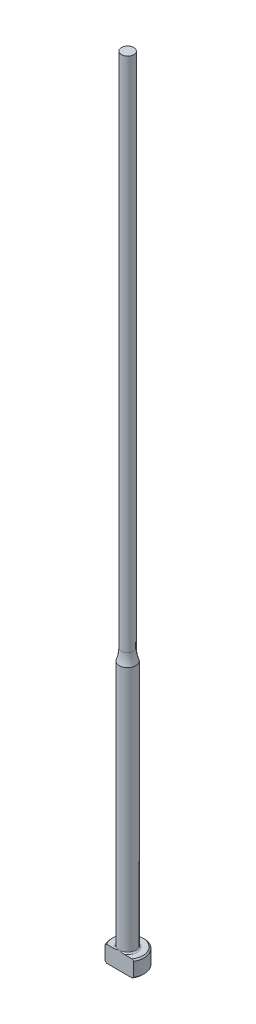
ISO-10303-21;
HEADER;
FILE_DESCRIPTION(('STEP AP214'),'2;1');
FILE_NAME('part.step','',(''),(''),'','','');
FILE_SCHEMA(('AUTOMOTIVE_DESIGN { 1 0 10303 214 1 1 1 1 }'));
ENDSEC;
DATA;
#1=APPLICATION_CONTEXT('core data for automotive mechanical design processes');
#2=APPLICATION_PROTOCOL_DEFINITION('international standard','automotive_design',2000,#1);
#3=PRODUCT_CONTEXT('',#1,'mechanical');
#4=PRODUCT('Part','Part','',(#3));
#5=PRODUCT_RELATED_PRODUCT_CATEGORY('part','',(#4));
#6=PRODUCT_DEFINITION_FORMATION('','',#4);
#7=PRODUCT_DEFINITION_CONTEXT('part definition',#1,'design');
#8=PRODUCT_DEFINITION('design','',#6,#7);
#9=PRODUCT_DEFINITION_SHAPE('','',#8);
#10=(LENGTH_UNIT() NAMED_UNIT(*) SI_UNIT(.MILLI.,.METRE.));
#11=(NAMED_UNIT(*) PLANE_ANGLE_UNIT() SI_UNIT($,.RADIAN.));
#12=(NAMED_UNIT(*) SI_UNIT($,.STERADIAN.) SOLID_ANGLE_UNIT());
#13=UNCERTAINTY_MEASURE_WITH_UNIT(LENGTH_MEASURE(1.E-05),#10,'distance_accuracy_value','');
#14=(GEOMETRIC_REPRESENTATION_CONTEXT(3) GLOBAL_UNCERTAINTY_ASSIGNED_CONTEXT((#13)) GLOBAL_UNIT_ASSIGNED_CONTEXT((#10,
#11,#12)) REPRESENTATION_CONTEXT('',''));
#15=CARTESIAN_POINT('',(0.,0.,0.));
#16=DIRECTION('',(0.,0.,1.));
#17=DIRECTION('',(1.,0.,0.));
#18=AXIS2_PLACEMENT_3D('',#15,#16,#17);
#19=CARTESIAN_POINT('',(-1.18998999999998,152.4,0.));
#20=DIRECTION('',(0.,1.,0.));
#21=DIRECTION('',(0.,0.,1.));
#22=AXIS2_PLACEMENT_3D('',#19,#20,#21);
#23=PLANE('',#22);
#24=CARTESIAN_POINT('',(0.,152.4,0.));
#25=DIRECTION('',(0.,1.,0.));
#26=DIRECTION('',(0.,0.,1.));
#27=AXIS2_PLACEMENT_3D('',#24,#25,#26);
#28=CIRCLE('',#27,1.18998999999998);
#29=CARTESIAN_POINT('',(0.,152.4,1.18998999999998));
#30=VERTEX_POINT('',#29);
#31=EDGE_CURVE('E169',#30,#30,#28,.T.);
#32=ORIENTED_EDGE('',*,*,#31,.T.);
#33=EDGE_LOOP('',(#32));
#34=FACE_BOUND('',#33,.T.);
#35=ADVANCED_FACE('F37',(#34),#23,.T.);
#36=CARTESIAN_POINT('',(0.,259.958771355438,0.));
#37=DIRECTION('',(0.,1.,0.));
#38=DIRECTION('',(0.,0.,1.));
#39=AXIS2_PLACEMENT_3D('',#36,#37,#38);
#40=CYLINDRICAL_SURFACE('',#39,1.18998999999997);
#41=CARTESIAN_POINT('',(0.,53.0114164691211,0.));
#42=DIRECTION('',(0.,1.,0.));
#43=DIRECTION('',(0.,0.,1.));
#44=AXIS2_PLACEMENT_3D('',#41,#42,#43);
#45=CIRCLE('',#44,1.18998999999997);
#46=CARTESIAN_POINT('',(0.,53.0114164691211,1.18998999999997));
#47=VERTEX_POINT('',#46);
#48=EDGE_CURVE('E172',#47,#47,#45,.T.);
#49=ORIENTED_EDGE('',*,*,#48,.T.);
#50=EDGE_LOOP('',(#49));
#51=FACE_BOUND('',#50,.T.);
#52=ORIENTED_EDGE('',*,*,#31,.F.);
#53=EDGE_LOOP('',(#52));
#54=FACE_BOUND('',#53,.T.);
#55=ADVANCED_FACE('F160',(#51,#54),#40,.T.);
#56=CARTESIAN_POINT('',(0.,53.0114164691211,0.));
#57=DIRECTION('',(0.,1.,0.));
#58=DIRECTION('',(0.,0.,1.));
#59=AXIS2_PLACEMENT_3D('',#56,#57,#58);
#60=TOROIDAL_SURFACE('',#59,7.53998999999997,6.35);
#61=CARTESIAN_POINT('',(0.,50.8,0.));
#62=DIRECTION('',(0.,1.,0.));
#63=DIRECTION('',(0.,0.,1.));
#64=AXIS2_PLACEMENT_3D('',#61,#62,#63);
#65=CIRCLE('',#64,1.58749999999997);
#66=CARTESIAN_POINT('',(0.,50.8,1.58749999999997));
#67=VERTEX_POINT('',#66);
#68=EDGE_CURVE('E100',#67,#67,#65,.T.);
#69=ORIENTED_EDGE('',*,*,#68,.T.);
#70=EDGE_LOOP('',(#69));
#71=FACE_BOUND('',#70,.T.);
#72=ORIENTED_EDGE('',*,*,#48,.F.);
#73=EDGE_LOOP('',(#72));
#74=FACE_BOUND('',#73,.T.);
#75=ADVANCED_FACE('F165',(#71,#74),#60,.F.);
#76=CARTESIAN_POINT('',(0.,259.958771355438,0.));
#77=DIRECTION('',(0.,1.,0.));
#78=DIRECTION('',(0.,0.,1.));
#79=AXIS2_PLACEMENT_3D('',#76,#77,#78);
#80=CYLINDRICAL_SURFACE('',#79,1.58749999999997);
#81=CARTESIAN_POINT('',(0.,3.42900000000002,0.));
#82=DIRECTION('',(0.,1.,0.));
#83=DIRECTION('',(0.,0.,1.));
#84=AXIS2_PLACEMENT_3D('',#81,#82,#83);
#85=CIRCLE('',#84,1.58749999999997);
#86=CARTESIAN_POINT('',(0.,3.42900000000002,1.58749999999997));
#87=VERTEX_POINT('',#86);
#88=EDGE_CURVE('E109',#87,#87,#85,.T.);
#89=ORIENTED_EDGE('',*,*,#88,.T.);
#90=EDGE_LOOP('',(#89));
#91=FACE_BOUND('',#90,.T.);
#92=ORIENTED_EDGE('',*,*,#68,.F.);
#93=EDGE_LOOP('',(#92));
#94=FACE_BOUND('',#93,.T.);
#95=ADVANCED_FACE('F192',(#91,#94),#80,.T.);
#96=CARTESIAN_POINT('',(-3.17499999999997,3.175,0.));
#97=DIRECTION('',(0.,1.,0.));
#98=DIRECTION('',(0.,0.,1.));
#99=AXIS2_PLACEMENT_3D('',#96,#97,#98);
#100=PLANE('',#99);
#101=DIRECTION('',(-1.,0.,0.));
#102=VECTOR('',#101,1.);
#103=CARTESIAN_POINT('',(-3.17499999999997,3.175,1.58749999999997));
#104=LINE('',#103,#102);
#105=CARTESIAN_POINT('',(2.45195529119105,3.175,1.58749999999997));
#106=VERTEX_POINT('',#105);
#107=CARTESIAN_POINT('',(0.933255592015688,3.175,1.58749999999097));
#108=VERTEX_POINT('',#107);
#109=EDGE_CURVE('E58',#106,#108,#104,.T.);
#110=ORIENTED_EDGE('',*,*,#109,.F.);
#111=CARTESIAN_POINT('',(0.,3.175,0.));
#112=DIRECTION('',(0.,1.,0.));
#113=DIRECTION('',(0.,0.,1.));
#114=AXIS2_PLACEMENT_3D('',#111,#112,#113);
#115=CIRCLE('',#114,2.92099999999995);
#116=CARTESIAN_POINT('',(-2.45195529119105,3.175,1.58749999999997));
#117=VERTEX_POINT('',#116);
#118=EDGE_CURVE('E171',#106,#117,#115,.T.);
#119=ORIENTED_EDGE('',*,*,#118,.T.);
#120=CARTESIAN_POINT('',(-0.933255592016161,3.17500000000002,1.58749999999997));
#121=VERTEX_POINT('',#120);
#122=EDGE_CURVE('E140',#121,#117,#104,.T.);
#123=ORIENTED_EDGE('',*,*,#122,.F.);
#124=CARTESIAN_POINT('',(0.,3.175,0.));
#125=DIRECTION('',(0.,1.,0.));
#126=DIRECTION('',(0.,0.,1.));
#127=AXIS2_PLACEMENT_3D('',#124,#125,#126);
#128=CIRCLE('',#127,1.84149999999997);
#129=EDGE_CURVE('E113',#121,#108,#128,.F.);
#130=ORIENTED_EDGE('',*,*,#129,.T.);
#131=EDGE_LOOP('',(#110,#119,#123,#130));
#132=FACE_BOUND('',#131,.T.);
#133=ADVANCED_FACE('F189',(#132),#100,.T.);
#134=CARTESIAN_POINT('',(0.,259.958771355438,0.));
#135=DIRECTION('',(0.,1.,0.));
#136=DIRECTION('',(0.,0.,1.));
#137=AXIS2_PLACEMENT_3D('',#134,#135,#136);
#138=CYLINDRICAL_SURFACE('',#137,3.17499999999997);
#139=DIRECTION('',(0.,-1.,0.));
#140=VECTOR('',#139,1.);
#141=CARTESIAN_POINT('',(-2.74963065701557,152.4,1.58749999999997));
#142=LINE('',#141,#140);
#143=CARTESIAN_POINT('',(-2.74963065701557,2.921,1.58749999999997));
#144=VERTEX_POINT('',#143);
#145=CARTESIAN_POINT('',(-2.74963065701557,0.254000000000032,1.58749999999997));
#146=VERTEX_POINT('',#145);
#147=EDGE_CURVE('E95',#144,#146,#142,.T.);
#148=ORIENTED_EDGE('',*,*,#147,.F.);
#149=CARTESIAN_POINT('',(0.,2.92100000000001,0.));
#150=DIRECTION('',(0.,1.,0.));
#151=DIRECTION('',(0.,0.,1.));
#152=AXIS2_PLACEMENT_3D('',#149,#150,#151);
#153=CIRCLE('',#152,3.17499999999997);
#154=CARTESIAN_POINT('',(2.74963065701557,2.921,1.58749999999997));
#155=VERTEX_POINT('',#154);
#156=EDGE_CURVE('E110',#144,#155,#153,.F.);
#157=ORIENTED_EDGE('',*,*,#156,.T.);
#158=DIRECTION('',(0.,-1.,0.));
#159=VECTOR('',#158,1.);
#160=CARTESIAN_POINT('',(2.74963065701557,152.4,1.58749999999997));
#161=LINE('',#160,#159);
#162=CARTESIAN_POINT('',(2.74963065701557,0.254000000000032,1.58749999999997));
#163=VERTEX_POINT('',#162);
#164=EDGE_CURVE('E182',#155,#163,#161,.T.);
#165=ORIENTED_EDGE('',*,*,#164,.T.);
#166=CARTESIAN_POINT('',(0.,0.254000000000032,0.));
#167=DIRECTION('',(0.,-1.,0.));
#168=DIRECTION('',(0.,0.,-1.));
#169=AXIS2_PLACEMENT_3D('',#166,#167,#168);
#170=CIRCLE('',#169,3.17499999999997);
#171=EDGE_CURVE('E116',#163,#146,#170,.F.);
#172=ORIENTED_EDGE('',*,*,#171,.T.);
#173=EDGE_LOOP('',(#148,#157,#165,#172));
#174=FACE_BOUND('',#173,.T.);
#175=ADVANCED_FACE('F180',(#174),#138,.T.);
#176=CARTESIAN_POINT('',(0.,0.,0.));
#177=DIRECTION('',(0.,-1.,0.));
#178=DIRECTION('',(0.,0.,-1.));
#179=AXIS2_PLACEMENT_3D('',#176,#177,#178);
#180=PLANE('',#179);
#181=DIRECTION('',(1.,0.,0.));
#182=VECTOR('',#181,1.);
#183=CARTESIAN_POINT('',(-2.74963065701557,0.,1.58749999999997));
#184=LINE('',#183,#182);
#185=CARTESIAN_POINT('',(-2.45195529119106,0.,1.58749999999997));
#186=VERTEX_POINT('',#185);
#187=CARTESIAN_POINT('',(2.45195529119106,0.,1.58749999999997));
#188=VERTEX_POINT('',#187);
#189=EDGE_CURVE('E92',#186,#188,#184,.T.);
#190=ORIENTED_EDGE('',*,*,#189,.F.);
#191=CARTESIAN_POINT('',(0.,0.,0.));
#192=DIRECTION('',(0.,-1.,0.));
#193=DIRECTION('',(0.,0.,-1.));
#194=AXIS2_PLACEMENT_3D('',#191,#192,#193);
#195=CIRCLE('',#194,2.92099999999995);
#196=EDGE_CURVE('E106',#186,#188,#195,.T.);
#197=ORIENTED_EDGE('',*,*,#196,.T.);
#198=EDGE_LOOP('',(#190,#197));
#199=FACE_BOUND('',#198,.T.);
#200=ADVANCED_FACE('F105',(#199),#180,.T.);
#201=CARTESIAN_POINT('',(0.,3.17499999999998,0.));
#202=DIRECTION('',(0.,-1.,0.));
#203=DIRECTION('',(0.,0.,-1.));
#204=AXIS2_PLACEMENT_3D('',#201,#202,#203);
#205=CONICAL_SURFACE('',#204,2.92099999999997,0.7853981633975);
#206=CARTESIAN_POINT('',(2.75033065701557,2.9203937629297,1.58749999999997));
#207=CARTESIAN_POINT('',(2.66887796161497,2.99091042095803,1.58749999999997));
#208=CARTESIAN_POINT('',(2.58705989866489,3.0610138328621,1.58749999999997));
#209=CARTESIAN_POINT('',(2.42241022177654,3.20009957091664,1.58749999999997));
#210=CARTESIAN_POINT('',(2.33957813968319,3.26908134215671,1.58749999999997));
#211=CARTESIAN_POINT('',(2.17073968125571,3.40716024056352,1.58749999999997));
#212=CARTESIAN_POINT('',(2.08470440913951,3.47622217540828,1.58749999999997));
#213=CARTESIAN_POINT('',(1.91099881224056,3.61222325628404,1.58749999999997));
#214=CARTESIAN_POINT('',(1.82332890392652,3.67916293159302,1.58749999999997));
#215=CARTESIAN_POINT('',(1.64569223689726,3.81020667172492,1.58749999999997));
#216=CARTESIAN_POINT('',(1.55572245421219,3.87430666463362,1.58749999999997));
#217=CARTESIAN_POINT('',(1.37280394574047,3.99833089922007,1.58749999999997));
#218=CARTESIAN_POINT('',(1.27985285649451,4.05825170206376,1.58749999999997));
#219=CARTESIAN_POINT('',(1.09086561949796,4.17130826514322,1.58749999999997));
#220=CARTESIAN_POINT('',(0.99485990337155,4.22449421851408,1.58749999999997));
#221=CARTESIAN_POINT('',(0.798114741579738,4.32122233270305,1.58749999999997));
#222=CARTESIAN_POINT('',(0.697384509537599,4.36478238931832,1.58749999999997));
#223=CARTESIAN_POINT('',(0.541185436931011,4.4195165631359,1.58749999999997));
#224=CARTESIAN_POINT('',(0.487627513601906,4.43611950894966,1.58749999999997));
#225=CARTESIAN_POINT('',(0.379267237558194,4.46466012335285,1.58749999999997));
#226=CARTESIAN_POINT('',(0.324465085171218,4.47659853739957,1.58749999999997));
#227=CARTESIAN_POINT('',(0.214272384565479,4.49501904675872,1.58749999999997));
#228=CARTESIAN_POINT('',(0.158887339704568,4.50153345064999,1.58749999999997));
#229=CARTESIAN_POINT('',(0.0477364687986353,4.50875028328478,1.58749999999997));
#230=CARTESIAN_POINT('',(-0.00802931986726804,4.50945327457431,1.58749999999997));
#231=CARTESIAN_POINT('',(-0.119372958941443,4.50499163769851,1.58749999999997));
#232=CARTESIAN_POINT('',(-0.174950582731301,4.49982147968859,1.58749999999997));
#233=CARTESIAN_POINT('',(-0.285312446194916,4.48399101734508,1.58749999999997));
#234=CARTESIAN_POINT('',(-0.340096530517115,4.47332965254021,1.58749999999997));
#235=CARTESIAN_POINT('',(-0.448865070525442,4.44711334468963,1.58749999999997));
#236=CARTESIAN_POINT('',(-0.50284128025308,4.43152477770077,1.58749999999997));
#237=CARTESIAN_POINT('',(-0.609429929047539,4.39628553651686,1.58749999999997));
#238=CARTESIAN_POINT('',(-0.66204236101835,4.3766348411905,1.58749999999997));
#239=CARTESIAN_POINT('',(-0.778129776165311,4.32902110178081,1.58749999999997));
#240=CARTESIAN_POINT('',(-0.84124591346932,4.30019026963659,1.58749999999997));
#241=CARTESIAN_POINT('',(-0.965594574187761,4.23868811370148,1.58749999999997));
#242=CARTESIAN_POINT('',(-1.02682597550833,4.20601455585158,1.58749999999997));
#243=CARTESIAN_POINT('',(-1.14774341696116,4.13769010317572,1.58749999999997));
#244=CARTESIAN_POINT('',(-1.20742632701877,4.10203371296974,1.58749999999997));
#245=CARTESIAN_POINT('',(-1.32539130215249,4.02846531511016,1.58749999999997));
#246=CARTESIAN_POINT('',(-1.38367308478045,3.9905528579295,1.58749999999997));
#247=CARTESIAN_POINT('',(-1.55734442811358,3.87382704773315,1.58749999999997));
#248=CARTESIAN_POINT('',(-1.67095842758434,3.79237897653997,1.58749999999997));
#249=CARTESIAN_POINT('',(-1.8947523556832,3.6252186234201,1.58749999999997));
#250=CARTESIAN_POINT('',(-2.00493591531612,3.53951111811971,1.58749999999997));
#251=CARTESIAN_POINT('',(-2.22248693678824,3.3655494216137,1.58749999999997));
#252=CARTESIAN_POINT('',(-2.32986450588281,3.27730782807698,1.58749999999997));
#253=CARTESIAN_POINT('',(-2.48909538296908,3.14389342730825,1.58749999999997));
#254=CARTESIAN_POINT('',(-2.54159338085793,3.09948435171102,1.58749999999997));
#255=CARTESIAN_POINT('',(-2.64622282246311,3.01024124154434,1.58749999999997));
#256=CARTESIAN_POINT('',(-2.69835428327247,2.96540722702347,1.58749999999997));
#257=CARTESIAN_POINT('',(-2.75033065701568,2.92039376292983,1.58749999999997));
#258=B_SPLINE_CURVE_WITH_KNOTS('',3,(#206,#207,#208,#209,#210,#211,#212,#213,#214,#215,#216,
#217,#218,#219,#220,#221,#222,#223,#224,#225,#226,#227,#228,#229,#230,#231,#232,#233,#234,#235,
#236,#237,#238,#239,#240,#241,#242,#243,#244,#245,#246,#247,#248,#249,#250,#251,#252,#253,#254,
#255,#256,#257),.UNSPECIFIED.,.F.,.F.,(4,2,2,2,2,2,2,2,2,2,2,2,2,2,2,2,2,2,2,2,2,2,2,2,2,4),(0.,
0.323216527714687,0.64658837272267,0.977539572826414,1.30840757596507,1.63973560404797,
1.97133312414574,2.30029221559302,2.62863448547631,2.79668277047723,2.9647041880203,
3.13171746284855,3.29871457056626,3.46586904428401,3.63305581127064,3.80140905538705,
3.96976317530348,4.17775353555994,4.38586541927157,4.59436953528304,4.80291533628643,
5.22209642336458,5.64081759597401,6.0577303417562,6.26401477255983,6.47028951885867),.UNSPECIFIED.);
#259=EDGE_CURVE('E63',#155,#106,#258,.T.);
#260=ORIENTED_EDGE('',*,*,#259,.F.);
#261=ORIENTED_EDGE('',*,*,#156,.F.);
#262=EDGE_CURVE('E133',#117,#144,#258,.T.);
#263=ORIENTED_EDGE('',*,*,#262,.F.);
#264=ORIENTED_EDGE('',*,*,#118,.F.);
#265=EDGE_LOOP('',(#260,#261,#263,#264));
#266=FACE_BOUND('',#265,.T.);
#267=ADVANCED_FACE('F147',(#266),#205,.T.);
#268=CARTESIAN_POINT('',(0.,0.254000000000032,0.));
#269=DIRECTION('',(0.,1.,0.));
#270=DIRECTION('',(0.,0.,1.));
#271=AXIS2_PLACEMENT_3D('',#268,#269,#270);
#272=CONICAL_SURFACE('',#271,3.17499999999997,0.785398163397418);
#273=CARTESIAN_POINT('',(-2.75033065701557,0.254606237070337,1.58749999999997));
#274=CARTESIAN_POINT('',(-2.66887796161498,0.184089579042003,1.58749999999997));
#275=CARTESIAN_POINT('',(-2.58705989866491,0.113986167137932,1.58749999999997));
#276=CARTESIAN_POINT('',(-2.42241022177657,-0.0250995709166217,1.58749999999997));
#277=CARTESIAN_POINT('',(-2.33957813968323,-0.0940813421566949,1.58749999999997));
#278=CARTESIAN_POINT('',(-2.17073968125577,-0.232160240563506,1.58749999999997));
#279=CARTESIAN_POINT('',(-2.08470440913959,-0.301222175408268,1.58749999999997));
#280=CARTESIAN_POINT('',(-1.91099881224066,-0.437223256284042,1.58749999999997));
#281=CARTESIAN_POINT('',(-1.82332890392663,-0.504162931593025,1.58749999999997));
#282=CARTESIAN_POINT('',(-1.64569223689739,-0.635206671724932,1.58749999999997));
#283=CARTESIAN_POINT('',(-1.55572245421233,-0.699306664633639,1.58749999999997));
#284=CARTESIAN_POINT('',(-1.37280394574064,-0.8233308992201,1.58749999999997));
#285=CARTESIAN_POINT('',(-1.27985285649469,-0.883251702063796,1.58749999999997));
#286=CARTESIAN_POINT('',(-1.09086561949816,-0.996308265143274,1.58749999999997));
#287=CARTESIAN_POINT('',(-0.994859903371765,-1.04949421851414,1.58749999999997));
#288=CARTESIAN_POINT('',(-0.798114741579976,-1.14622233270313,1.58749999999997));
#289=CARTESIAN_POINT('',(-0.697384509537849,-1.18978238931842,1.58749999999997));
#290=CARTESIAN_POINT('',(-0.54118543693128,-1.24451656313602,1.58749999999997));
#291=CARTESIAN_POINT('',(-0.487627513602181,-1.26111950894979,1.58749999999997));
#292=CARTESIAN_POINT('',(-0.379267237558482,-1.28966012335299,1.58749999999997));
#293=CARTESIAN_POINT('',(-0.324465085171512,-1.30159853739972,1.58749999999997));
#294=CARTESIAN_POINT('',(-0.214272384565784,-1.3200190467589,1.58749999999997));
#295=CARTESIAN_POINT('',(-0.158887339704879,-1.32653345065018,1.58749999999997));
#296=CARTESIAN_POINT('',(-0.0477364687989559,-1.33375028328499,1.58749999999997));
#297=CARTESIAN_POINT('',(0.00802931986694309,-1.33445327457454,1.58749999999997));
#298=CARTESIAN_POINT('',(0.119372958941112,-1.32999163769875,1.58749999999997));
#299=CARTESIAN_POINT('',(0.174950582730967,-1.32482147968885,1.58749999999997));
#300=CARTESIAN_POINT('',(0.28531244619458,-1.30899101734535,1.58749999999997));
#301=CARTESIAN_POINT('',(0.340096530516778,-1.2983296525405,1.58749999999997));
#302=CARTESIAN_POINT('',(0.448865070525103,-1.27211334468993,1.58749999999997));
#303=CARTESIAN_POINT('',(0.50284128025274,-1.25652477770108,1.58749999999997));
#304=CARTESIAN_POINT('',(0.609429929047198,-1.22128553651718,1.58749999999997));
#305=CARTESIAN_POINT('',(0.662042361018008,-1.20163484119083,1.58749999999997));
#306=CARTESIAN_POINT('',(0.778129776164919,-1.15402110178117,1.58749999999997));
#307=CARTESIAN_POINT('',(0.84124591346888,-1.12519026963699,1.58749999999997));
#308=CARTESIAN_POINT('',(0.965594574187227,-1.06368811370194,1.58749999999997));
#309=CARTESIAN_POINT('',(1.02682597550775,-1.03101455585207,1.58749999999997));
#310=CARTESIAN_POINT('',(1.14774341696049,-0.962690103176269,1.58749999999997));
#311=CARTESIAN_POINT('',(1.20742632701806,-0.927033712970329,1.58749999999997));
#312=CARTESIAN_POINT('',(1.32539130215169,-0.853465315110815,1.58749999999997));
#313=CARTESIAN_POINT('',(1.38367308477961,-0.815552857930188,1.58749999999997));
#314=CARTESIAN_POINT('',(1.5573444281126,-0.698827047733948,1.58749999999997));
#315=CARTESIAN_POINT('',(1.67095842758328,-0.617378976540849,1.58749999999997));
#316=CARTESIAN_POINT('',(1.89475235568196,-0.450218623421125,1.58749999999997));
#317=CARTESIAN_POINT('',(2.0049359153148,-0.364511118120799,1.58749999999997));
#318=CARTESIAN_POINT('',(2.22248693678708,-0.190549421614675,1.58749999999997));
#319=CARTESIAN_POINT('',(2.32986450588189,-0.102307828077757,1.58749999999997));
#320=CARTESIAN_POINT('',(2.48909538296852,0.0311065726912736,1.58749999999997));
#321=CARTESIAN_POINT('',(2.54159338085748,0.0755156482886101,1.58749999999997));
#322=CARTESIAN_POINT('',(2.64622282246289,0.164758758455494,1.58749999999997));
#323=CARTESIAN_POINT('',(2.69835428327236,0.20959277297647,1.58749999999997));
#324=CARTESIAN_POINT('',(2.75033065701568,0.25460623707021,1.58749999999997));
#325=B_SPLINE_CURVE_WITH_KNOTS('',3,(#273,#274,#275,#276,#277,#278,#279,#280,#281,#282,#283,
#284,#285,#286,#287,#288,#289,#290,#291,#292,#293,#294,#295,#296,#297,#298,#299,#300,#301,#302,
#303,#304,#305,#306,#307,#308,#309,#310,#311,#312,#313,#314,#315,#316,#317,#318,#319,#320,#321,
#322,#323,#324),.UNSPECIFIED.,.F.,.F.,(4,2,2,2,2,2,2,2,2,2,2,2,2,2,2,2,2,2,2,2,2,2,2,2,2,4),(0.,
0.323216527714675,0.646588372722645,0.977539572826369,1.308407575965,1.63973560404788,
1.97133312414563,2.3002922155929,2.62863448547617,2.79668277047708,2.96470418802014,
3.13171746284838,3.29871457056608,3.46586904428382,3.63305581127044,3.80140905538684,
3.96976317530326,4.17775353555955,4.38586541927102,4.59436953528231,4.80291533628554,
5.22209642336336,5.64081759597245,6.05773034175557,6.26401477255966,6.47028951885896),.UNSPECIFIED.);
#326=EDGE_CURVE('E89',#146,#186,#325,.T.);
#327=ORIENTED_EDGE('',*,*,#326,.F.);
#328=ORIENTED_EDGE('',*,*,#171,.F.);
#329=EDGE_CURVE('E101',#188,#163,#325,.T.);
#330=ORIENTED_EDGE('',*,*,#329,.F.);
#331=ORIENTED_EDGE('',*,*,#196,.F.);
#332=EDGE_LOOP('',(#327,#328,#330,#331));
#333=FACE_BOUND('',#332,.T.);
#334=ADVANCED_FACE('F108',(#333),#272,.T.);
#335=CARTESIAN_POINT('',(0.,3.42900000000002,0.));
#336=DIRECTION('',(0.,1.,0.));
#337=DIRECTION('',(0.,0.,1.));
#338=AXIS2_PLACEMENT_3D('',#335,#336,#337);
#339=TOROIDAL_SURFACE('',#338,1.84149999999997,0.254);
#340=ORIENTED_EDGE('',*,*,#129,.F.);
#341=CARTESIAN_POINT('',(0.,3.42900000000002,1.58749999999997));
#342=CARTESIAN_POINT('',(-1.9220500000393E-10,3.42900057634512,1.58749999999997));
#343=CARTESIAN_POINT('',(-1.22611614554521E-07,3.42900115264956,1.58749999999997));
#344=CARTESIAN_POINT('',(-5.09676364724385E-07,3.42900226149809,1.58749999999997));
#345=CARTESIAN_POINT('',(-7.78176327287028E-07,3.42900279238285,1.58749999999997));
#346=CARTESIAN_POINT('',(-1.42307272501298E-06,3.42900385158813,1.58749999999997));
#347=CARTESIAN_POINT('',(-1.80713867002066E-06,3.42900437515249,1.58749999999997));
#348=CARTESIAN_POINT('',(-2.63494846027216E-06,3.42900536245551,1.58749999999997));
#349=CARTESIAN_POINT('',(-3.07814756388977E-06,3.42900582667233,1.58749999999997));
#350=CARTESIAN_POINT('',(-4.66897357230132E-06,3.42900738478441,1.58749999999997));
#351=CARTESIAN_POINT('',(-5.89404907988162E-06,3.42900840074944,1.58749999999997));
#352=CARTESIAN_POINT('',(-8.42427510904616E-06,3.42901020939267,1.58749999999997));
#353=CARTESIAN_POINT('',(-9.72480574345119E-06,3.42901100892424,1.58749999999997));
#354=CARTESIAN_POINT('',(-1.48060601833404E-05,3.42901401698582,1.58749999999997));
#355=CARTESIAN_POINT('',(-1.86838281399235E-05,3.42901606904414,1.58749999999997));
#356=CARTESIAN_POINT('',(-2.63261117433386E-05,3.42901942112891,1.58749999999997));
#357=CARTESIAN_POINT('',(-3.0068741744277E-05,3.42902077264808,1.58749999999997));
#358=CARTESIAN_POINT('',(-4.60276298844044E-05,3.42902652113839,1.58749999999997));
#359=CARTESIAN_POINT('',(-5.82470198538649E-05,3.42903088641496,1.58749999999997));
#360=CARTESIAN_POINT('',(-8.11070097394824E-05,3.42903788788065,1.58749999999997));
#361=CARTESIAN_POINT('',(-9.16953114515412E-05,3.42904068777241,1.58749999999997));
#362=CARTESIAN_POINT('',(-0.000168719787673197,3.42906287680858,1.58749999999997));
#363=CARTESIAN_POINT('',(-0.000232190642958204,3.4290911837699,1.58749999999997));
#364=CARTESIAN_POINT('',(-0.000479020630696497,3.42919723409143,1.58749999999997));
#365=CARTESIAN_POINT('',(-0.000664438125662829,3.42926834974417,1.58749999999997));
#366=CARTESIAN_POINT('',(-0.0013844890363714,3.42954862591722,1.58749999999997));
#367=CARTESIAN_POINT('',(-0.00191701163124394,3.42976473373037,1.58749999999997));
#368=CARTESIAN_POINT('',(-0.00409774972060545,3.4306455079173,1.58749999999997));
#369=CARTESIAN_POINT('',(-0.00574830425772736,3.43130231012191,1.58749999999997));
#370=CARTESIAN_POINT('',(-0.0289985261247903,3.4405594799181,1.58749999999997));
#371=CARTESIAN_POINT('',(-0.0505816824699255,3.4492167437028,1.58749999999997));
#372=CARTESIAN_POINT('',(-0.0929947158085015,3.46610702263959,1.58749999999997));
#373=CARTESIAN_POINT('',(-0.113823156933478,3.47434394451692,1.58749999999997));
#374=CARTESIAN_POINT('',(-0.157956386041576,3.49164606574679,1.58749999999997));
#375=CARTESIAN_POINT('',(-0.181267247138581,3.50069608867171,1.58749999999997));
#376=CARTESIAN_POINT('',(-0.228222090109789,3.51863224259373,1.58749999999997));
#377=CARTESIAN_POINT('',(-0.25186705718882,3.52751579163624,1.58749999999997));
#378=CARTESIAN_POINT('',(-0.310512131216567,3.54905503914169,1.58749999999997));
#379=CARTESIAN_POINT('',(-0.345588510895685,3.56150550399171,1.58749999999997));
#380=CARTESIAN_POINT('',(-0.415278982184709,3.5850302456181,1.58749999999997));
#381=CARTESIAN_POINT('',(-0.449884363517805,3.59613012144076,1.58749999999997));
#382=CARTESIAN_POINT('',(-0.524471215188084,3.61841679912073,1.58749999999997));
#383=CARTESIAN_POINT('',(-0.564517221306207,3.62939137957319,1.58749999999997));
#384=CARTESIAN_POINT('',(-0.645529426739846,3.6489746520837,1.58749999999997));
#385=CARTESIAN_POINT('',(-0.686500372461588,3.65756417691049,1.58749999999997));
#386=CARTESIAN_POINT('',(-0.771546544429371,3.67188287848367,1.58749999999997));
#387=CARTESIAN_POINT('',(-0.815658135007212,3.67740449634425,1.58749999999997));
#388=CARTESIAN_POINT('',(-0.904117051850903,3.68344603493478,1.58749999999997));
#389=CARTESIAN_POINT('',(-0.948462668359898,3.68398638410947,1.58749999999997));
#390=CARTESIAN_POINT('',(-1.02531896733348,3.67901051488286,1.58749999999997));
#391=CARTESIAN_POINT('',(-1.05792141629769,3.67502604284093,1.58749999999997));
#392=CARTESIAN_POINT('',(-1.12184393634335,3.66230832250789,1.58749999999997));
#393=CARTESIAN_POINT('',(-1.1531753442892,3.65363950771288,1.58749999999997));
#394=CARTESIAN_POINT('',(-1.19946468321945,3.6356384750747,1.58749999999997));
#395=CARTESIAN_POINT('',(-1.21526783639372,3.62848492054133,1.58749999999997));
#396=CARTESIAN_POINT('',(-1.24583726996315,3.61212937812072,1.58749999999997));
#397=CARTESIAN_POINT('',(-1.26060215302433,3.60292469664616,1.58749999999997));
#398=CARTESIAN_POINT('',(-1.28575815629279,3.58421518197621,1.58749999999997));
#399=CARTESIAN_POINT('',(-1.29644383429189,3.57510998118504,1.58749999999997));
#400=CARTESIAN_POINT('',(-1.31623154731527,3.55531539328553,1.58749999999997));
#401=CARTESIAN_POINT('',(-1.32533681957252,3.54462932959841,1.58749999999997));
#402=CARTESIAN_POINT('',(-1.33941140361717,3.52450022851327,1.58749999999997));
#403=CARTESIAN_POINT('',(-1.34484814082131,3.51538553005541,1.58749999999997));
#404=CARTESIAN_POINT('',(-1.35416329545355,3.49638544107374,1.58749999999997));
#405=CARTESIAN_POINT('',(-1.35804267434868,3.48650053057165,1.58749999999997));
#406=CARTESIAN_POINT('',(-1.36398436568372,3.46611321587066,1.58749999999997));
#407=CARTESIAN_POINT('',(-1.36603350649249,3.45560690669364,1.58749999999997));
#408=CARTESIAN_POINT('',(-1.3680840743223,3.43439627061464,1.58749999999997));
#409=CARTESIAN_POINT('',(-1.36808648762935,3.42369204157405,1.58749999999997));
#410=CARTESIAN_POINT('',(-1.36616208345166,3.40366716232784,1.58749999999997));
#411=CARTESIAN_POINT('',(-1.36444960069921,3.39432493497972,1.58749999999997));
#412=CARTESIAN_POINT('',(-1.35953338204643,3.37604480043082,1.58749999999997));
#413=CARTESIAN_POINT('',(-1.3563294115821,3.36710695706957,1.58749999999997));
#414=CARTESIAN_POINT('',(-1.34848006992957,3.34949697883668,1.58749999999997));
#415=CARTESIAN_POINT('',(-1.34378578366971,3.34084688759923,1.58749999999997));
#416=CARTESIAN_POINT('',(-1.33324445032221,3.32428742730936,1.58749999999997));
#417=CARTESIAN_POINT('',(-1.32739692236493,3.31637836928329,1.58749999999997));
#418=CARTESIAN_POINT('',(-1.31107304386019,3.29692878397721,1.58749999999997));
#419=CARTESIAN_POINT('',(-1.29989286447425,3.28597778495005,1.58749999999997));
#420=CARTESIAN_POINT('',(-1.27593566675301,3.26597490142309,1.58749999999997));
#421=CARTESIAN_POINT('',(-1.2631537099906,3.25692913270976,1.58749999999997));
#422=CARTESIAN_POINT('',(-1.22930733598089,3.23613976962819,1.58749999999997));
#423=CARTESIAN_POINT('',(-1.20751096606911,3.22559415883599,1.58749999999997));
#424=CARTESIAN_POINT('',(-1.16266144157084,3.20795356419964,1.58749999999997));
#425=CARTESIAN_POINT('',(-1.13960937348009,3.20085564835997,1.58749999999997));
#426=CARTESIAN_POINT('',(-1.07603916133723,3.18534571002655,1.58749999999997));
#427=CARTESIAN_POINT('',(-1.03486686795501,3.17965078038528,1.58749999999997));
#428=CARTESIAN_POINT('',(-0.951558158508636,3.1741711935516,1.58749999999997));
#429=CARTESIAN_POINT('',(-0.909417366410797,3.17449023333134,1.58749999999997));
#430=CARTESIAN_POINT('',(-0.811383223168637,3.18054602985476,1.58749999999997));
#431=CARTESIAN_POINT('',(-0.755610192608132,3.18806126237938,1.58749999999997));
#432=CARTESIAN_POINT('',(-0.644937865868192,3.20866626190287,1.58749999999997));
#433=CARTESIAN_POINT('',(-0.590043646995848,3.2217810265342,1.58749999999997));
#434=CARTESIAN_POINT('',(-0.485757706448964,3.25059077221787,1.58749999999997));
#435=CARTESIAN_POINT('',(-0.436281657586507,3.2659890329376,1.58749999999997));
#436=CARTESIAN_POINT('',(-0.338551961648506,3.29877502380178,1.58749999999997));
#437=CARTESIAN_POINT('',(-0.290291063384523,3.31614156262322,1.58749999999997));
#438=CARTESIAN_POINT('',(-0.225557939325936,3.34039762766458,1.58749999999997));
#439=CARTESIAN_POINT('',(-0.208874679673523,3.34673586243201,1.58749999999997));
#440=CARTESIAN_POINT('',(-0.175123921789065,3.35969957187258,1.58749999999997));
#441=CARTESIAN_POINT('',(-0.158057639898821,3.36632823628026,1.58749999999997));
#442=CARTESIAN_POINT('',(-0.117638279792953,3.38214476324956,1.58749999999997));
#443=CARTESIAN_POINT('',(-0.0943002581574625,3.39137029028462,1.58749999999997));
#444=CARTESIAN_POINT('',(-0.049782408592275,3.40910304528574,1.58749999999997));
#445=CARTESIAN_POINT('',(-0.028598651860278,3.41759960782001,1.58749999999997));
#446=CARTESIAN_POINT('',(-0.00575168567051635,3.42669635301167,1.58749999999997));
#447=CARTESIAN_POINT('',(-0.00410451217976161,3.42735181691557,1.58749999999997));
#448=CARTESIAN_POINT('',(-0.00192459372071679,3.42823223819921,1.58749999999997));
#449=CARTESIAN_POINT('',(-0.00138952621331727,3.42844937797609,1.58749999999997));
#450=CARTESIAN_POINT('',(-0.000666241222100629,3.42873091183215,1.58749999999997));
#451=CARTESIAN_POINT('',(-0.000480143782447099,3.42880228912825,1.58749999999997));
#452=CARTESIAN_POINT('',(-0.000232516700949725,3.4289086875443,1.58749999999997));
#453=CARTESIAN_POINT('',(-0.00016892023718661,3.42893705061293,1.58749999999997));
#454=CARTESIAN_POINT('',(-9.17527161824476E-05,3.42895927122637,1.58749999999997));
#455=CARTESIAN_POINT('',(-8.11550293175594E-05,3.42896207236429,1.58749999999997));
#456=CARTESIAN_POINT('',(-5.82743948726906E-05,3.4289690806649,1.58749999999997));
#457=CARTESIAN_POINT('',(-4.60440001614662E-05,3.4289734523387,1.58749999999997));
#458=CARTESIAN_POINT('',(-3.00727682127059E-05,3.42897920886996,1.58749999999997));
#459=CARTESIAN_POINT('',(-2.63286807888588E-05,3.42898056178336,1.58749999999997));
#460=CARTESIAN_POINT('',(-1.86836529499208E-05,3.42898391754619,1.58749999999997));
#461=CARTESIAN_POINT('',(-1.48046517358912E-05,3.42898597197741,1.58749999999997));
#462=CARTESIAN_POINT('',(-9.72223943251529E-06,3.42898898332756,1.58749999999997));
#463=CARTESIAN_POINT('',(-8.4215964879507E-06,3.4289897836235,1.58749999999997));
#464=CARTESIAN_POINT('',(-5.89129728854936E-06,3.428991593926,1.58749999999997));
#465=CARTESIAN_POINT('',(-4.66626866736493E-06,3.42899261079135,1.58749999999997));
#466=CARTESIAN_POINT('',(-3.07568803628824E-06,3.42899417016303,1.58749999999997));
#467=CARTESIAN_POINT('',(-2.63259565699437E-06,3.42899463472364,1.58749999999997));
#468=CARTESIAN_POINT('',(-1.80506085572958E-06,3.42899562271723,1.58749999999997));
#469=CARTESIAN_POINT('',(-1.42116387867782E-06,3.4289961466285,1.58749999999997));
#470=CARTESIAN_POINT('',(-7.76675642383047E-07,3.42899720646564,1.58749999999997));
#471=CARTESIAN_POINT('',(-5.08406487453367E-07,3.42899773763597,1.58749999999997));
#472=CARTESIAN_POINT('',(-1.21901887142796E-07,3.42899884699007,1.58749999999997));
#473=CARTESIAN_POINT('',(1.92251529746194E-10,3.42899942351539,1.58749999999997));
#474=CARTESIAN_POINT('',(0.,3.42900000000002,1.58749999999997));
#475=B_SPLINE_CURVE_WITH_KNOTS('',3,(#341,#342,#343,#344,#345,#346,#347,#348,#349,#350,#351,
#352,#353,#354,#355,#356,#357,#358,#359,#360,#361,#362,#363,#364,#365,#366,#367,#368,#369,#370,
#371,#372,#373,#374,#375,#376,#377,#378,#379,#380,#381,#382,#383,#384,#385,#386,#387,#388,#389,
#390,#391,#392,#393,#394,#395,#396,#397,#398,#399,#400,#401,#402,#403,#404,#405,#406,#407,#408,
#409,#410,#411,#412,#413,#414,#415,#416,#417,#418,#419,#420,#421,#422,#423,#424,#425,#426,#427,
#428,#429,#430,#431,#432,#433,#434,#435,#436,#437,#438,#439,#440,#441,#442,#443,#444,#445,#446,
#447,#448,#449,#450,#451,#452,#453,#454,#455,#456,#457,#458,#459,#460,#461,#462,#463,#464,#465,
#466,#467,#468,#469,#470,#471,#472,#473,#474),.UNSPECIFIED.,.T.,.F.,(4,2,2,2,2,2,2,2,2,2,2,2,2,
2,2,2,2,2,2,2,2,2,2,2,2,2,2,2,2,2,2,2,2,2,2,2,2,2,2,2,2,2,2,2,2,2,2,2,2,2,2,2,2,2,2,2,2,2,2,2,2,
2,2,2,2,2,4),(0.,1.72815459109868E-06,3.50429256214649E-06,5.44431005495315E-06,
7.36755250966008E-06,1.21190896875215E-05,1.66953775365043E-05,2.98160400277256E-05,
4.17409564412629E-05,8.06604753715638E-05,0.000113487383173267,0.000321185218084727,
0.000917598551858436,0.00264089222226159,0.00797105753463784,0.0777276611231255,
0.144923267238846,0.219939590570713,0.295714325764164,0.407362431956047,0.516367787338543,
0.640878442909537,0.766362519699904,0.899536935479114,1.03216495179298,1.130457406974,
1.22743103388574,1.27935899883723,1.33135556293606,1.3733324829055,1.41522237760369,
1.44693946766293,1.47863694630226,1.51056074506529,1.54246916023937,1.57083210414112,
1.59919951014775,1.62861579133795,1.65804436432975,1.70472658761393,1.75155645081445,
1.82378709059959,1.89595619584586,2.01995471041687,2.14609321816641,2.31447224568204,
2.4836109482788,2.63898919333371,2.79283011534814,2.8463703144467,2.90129461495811,
2.9765823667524,3.04504771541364,3.05036697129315,3.0520984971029,3.0526970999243,
3.05290520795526,3.05293806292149,3.05297701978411,3.05298895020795,3.05300207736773,
3.05300665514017,3.05301140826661,3.0530133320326,3.05301527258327,3.05301704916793,
3.05301877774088),.UNSPECIFIED.);
#476=EDGE_CURVE('E11',#121,#87,#475,.T.);
#477=ORIENTED_EDGE('',*,*,#476,.T.);
#478=ORIENTED_EDGE('',*,*,#88,.F.);
#479=CARTESIAN_POINT('',(0.,3.42900000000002,1.58749999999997));
#480=CARTESIAN_POINT('',(1.92205030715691E-10,3.42899942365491,1.58749999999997));
#481=CARTESIAN_POINT('',(1.22611614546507E-07,3.42899884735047,1.58749999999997));
#482=CARTESIAN_POINT('',(5.09676364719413E-07,3.42899773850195,1.58749999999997));
#483=CARTESIAN_POINT('',(7.78176327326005E-07,3.42899720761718,1.58749999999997));
#484=CARTESIAN_POINT('',(1.42307272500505E-06,3.4289961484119,1.58749999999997));
#485=CARTESIAN_POINT('',(1.80713866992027E-06,3.42899562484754,1.58749999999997));
#486=CARTESIAN_POINT('',(2.63494846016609E-06,3.42899463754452,1.58749999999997));
#487=CARTESIAN_POINT('',(3.07814756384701E-06,3.4289941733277,1.58749999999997));
#488=CARTESIAN_POINT('',(4.66897357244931E-06,3.42899261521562,1.58749999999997));
#489=CARTESIAN_POINT('',(5.89404907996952E-06,3.42899159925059,1.58749999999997));
#490=CARTESIAN_POINT('',(8.42427510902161E-06,3.42898979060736,1.58749999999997));
#491=CARTESIAN_POINT('',(9.72480574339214E-06,3.42898899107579,1.58749999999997));
#492=CARTESIAN_POINT('',(1.48060601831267E-05,3.42898598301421,1.58749999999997));
#493=CARTESIAN_POINT('',(1.86838281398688E-05,3.42898393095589,1.58749999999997));
#494=CARTESIAN_POINT('',(2.63261117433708E-05,3.42898057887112,1.58749999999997));
#495=CARTESIAN_POINT('',(3.00687417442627E-05,3.42897922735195,1.58749999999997));
#496=CARTESIAN_POINT('',(4.6027629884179E-05,3.42897347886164,1.58749999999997));
#497=CARTESIAN_POINT('',(5.82470198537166E-05,3.42896911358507,1.58749999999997));
#498=CARTESIAN_POINT('',(8.1107009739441E-05,3.42896211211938,1.58749999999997));
#499=CARTESIAN_POINT('',(9.16953114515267E-05,3.42895931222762,1.58749999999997));
#500=CARTESIAN_POINT('',(0.00016871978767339,3.42893712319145,1.58749999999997));
#501=CARTESIAN_POINT('',(0.000232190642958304,3.42890881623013,1.58749999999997));
#502=CARTESIAN_POINT('',(0.000479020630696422,3.4288027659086,1.58749999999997));
#503=CARTESIAN_POINT('',(0.000664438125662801,3.42873165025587,1.58749999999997));
#504=CARTESIAN_POINT('',(0.0013844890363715,3.42845137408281,1.58749999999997));
#505=CARTESIAN_POINT('',(0.00191701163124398,3.42823526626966,1.58749999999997));
#506=CARTESIAN_POINT('',(0.00409774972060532,3.42735449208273,1.58749999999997));
#507=CARTESIAN_POINT('',(0.0057483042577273,3.42669768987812,1.58749999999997));
#508=CARTESIAN_POINT('',(0.028998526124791,3.41744052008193,1.58749999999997));
#509=CARTESIAN_POINT('',(0.0505816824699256,3.40878325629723,1.58749999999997));
#510=CARTESIAN_POINT('',(0.0929947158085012,3.39189297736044,1.58749999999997));
#511=CARTESIAN_POINT('',(0.113823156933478,3.38365605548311,1.58749999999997));
#512=CARTESIAN_POINT('',(0.157956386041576,3.36635393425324,1.58749999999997));
#513=CARTESIAN_POINT('',(0.181267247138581,3.35730391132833,1.58749999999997));
#514=CARTESIAN_POINT('',(0.228222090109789,3.3393677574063,1.58749999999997));
#515=CARTESIAN_POINT('',(0.25186705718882,3.33048420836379,1.58749999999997));
#516=CARTESIAN_POINT('',(0.310512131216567,3.30894496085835,1.58749999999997));
#517=CARTESIAN_POINT('',(0.345588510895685,3.29649449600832,1.58749999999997));
#518=CARTESIAN_POINT('',(0.415278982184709,3.27296975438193,1.58749999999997));
#519=CARTESIAN_POINT('',(0.449884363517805,3.26186987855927,1.58749999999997));
#520=CARTESIAN_POINT('',(0.524471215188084,3.2395832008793,1.58749999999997));
#521=CARTESIAN_POINT('',(0.564517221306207,3.22860862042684,1.58749999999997));
#522=CARTESIAN_POINT('',(0.645529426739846,3.20902534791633,1.58749999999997));
#523=CARTESIAN_POINT('',(0.686500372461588,3.20043582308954,1.58749999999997));
#524=CARTESIAN_POINT('',(0.771546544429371,3.18611712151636,1.58749999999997));
#525=CARTESIAN_POINT('',(0.815658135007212,3.18059550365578,1.58749999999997));
#526=CARTESIAN_POINT('',(0.904117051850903,3.17455396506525,1.58749999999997));
#527=CARTESIAN_POINT('',(0.948462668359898,3.17401361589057,1.58749999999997));
#528=CARTESIAN_POINT('',(1.02531896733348,3.17898948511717,1.58749999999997));
#529=CARTESIAN_POINT('',(1.05792141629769,3.1829739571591,1.58749999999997));
#530=CARTESIAN_POINT('',(1.12184393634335,3.19569167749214,1.58749999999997));
#531=CARTESIAN_POINT('',(1.1531753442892,3.20436049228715,1.58749999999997));
#532=CARTESIAN_POINT('',(1.19946468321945,3.22236152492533,1.58749999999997));
#533=CARTESIAN_POINT('',(1.21526783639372,3.2295150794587,1.58749999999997));
#534=CARTESIAN_POINT('',(1.24583726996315,3.24587062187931,1.58749999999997));
#535=CARTESIAN_POINT('',(1.26060215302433,3.25507530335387,1.58749999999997));
#536=CARTESIAN_POINT('',(1.28575815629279,3.27378481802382,1.58749999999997));
#537=CARTESIAN_POINT('',(1.29644383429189,3.28289001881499,1.58749999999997));
#538=CARTESIAN_POINT('',(1.31623154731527,3.30268460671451,1.58749999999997));
#539=CARTESIAN_POINT('',(1.32533681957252,3.31337067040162,1.58749999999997));
#540=CARTESIAN_POINT('',(1.33941140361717,3.33349977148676,1.58749999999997));
#541=CARTESIAN_POINT('',(1.34484814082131,3.34261446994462,1.58749999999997));
#542=CARTESIAN_POINT('',(1.35416329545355,3.36161455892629,1.58749999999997));
#543=CARTESIAN_POINT('',(1.35804267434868,3.37149946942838,1.58749999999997));
#544=CARTESIAN_POINT('',(1.36398436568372,3.39188678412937,1.58749999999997));
#545=CARTESIAN_POINT('',(1.36603350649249,3.40239309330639,1.58749999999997));
#546=CARTESIAN_POINT('',(1.3680840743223,3.42360372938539,1.58749999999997));
#547=CARTESIAN_POINT('',(1.36808648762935,3.43430795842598,1.58749999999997));
#548=CARTESIAN_POINT('',(1.36616208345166,3.45433283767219,1.58749999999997));
#549=CARTESIAN_POINT('',(1.36444960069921,3.46367506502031,1.58749999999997));
#550=CARTESIAN_POINT('',(1.35953338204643,3.48195519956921,1.58749999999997));
#551=CARTESIAN_POINT('',(1.3563294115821,3.49089304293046,1.58749999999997));
#552=CARTESIAN_POINT('',(1.34848006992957,3.50850302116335,1.58749999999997));
#553=CARTESIAN_POINT('',(1.34378578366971,3.5171531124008,1.58749999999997));
#554=CARTESIAN_POINT('',(1.33324445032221,3.53371257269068,1.58749999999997));
#555=CARTESIAN_POINT('',(1.32739692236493,3.54162163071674,1.58749999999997));
#556=CARTESIAN_POINT('',(1.31107304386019,3.56107121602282,1.58749999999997));
#557=CARTESIAN_POINT('',(1.29989286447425,3.57202221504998,1.58749999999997));
#558=CARTESIAN_POINT('',(1.27593566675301,3.59202509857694,1.58749999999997));
#559=CARTESIAN_POINT('',(1.2631537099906,3.60107086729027,1.58749999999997));
#560=CARTESIAN_POINT('',(1.22930733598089,3.62186023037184,1.58749999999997));
#561=CARTESIAN_POINT('',(1.20751096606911,3.63240584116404,1.58749999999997));
#562=CARTESIAN_POINT('',(1.16266144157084,3.65004643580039,1.58749999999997));
#563=CARTESIAN_POINT('',(1.13960937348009,3.65714435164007,1.58749999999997));
#564=CARTESIAN_POINT('',(1.07603916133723,3.67265428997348,1.58749999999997));
#565=CARTESIAN_POINT('',(1.03486686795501,3.67834921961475,1.58749999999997));
#566=CARTESIAN_POINT('',(0.951558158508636,3.68382880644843,1.58749999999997));
#567=CARTESIAN_POINT('',(0.909417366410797,3.68350976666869,1.58749999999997));
#568=CARTESIAN_POINT('',(0.811383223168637,3.67745397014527,1.58749999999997));
#569=CARTESIAN_POINT('',(0.755610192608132,3.66993873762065,1.58749999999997));
#570=CARTESIAN_POINT('',(0.644937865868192,3.64933373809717,1.58749999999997));
#571=CARTESIAN_POINT('',(0.590043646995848,3.63621897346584,1.58749999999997));
#572=CARTESIAN_POINT('',(0.485757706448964,3.60740922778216,1.58749999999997));
#573=CARTESIAN_POINT('',(0.436281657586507,3.59201096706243,1.58749999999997));
#574=CARTESIAN_POINT('',(0.338551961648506,3.55922497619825,1.58749999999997));
#575=CARTESIAN_POINT('',(0.290291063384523,3.54185843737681,1.58749999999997));
#576=CARTESIAN_POINT('',(0.225557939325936,3.51760237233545,1.58749999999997));
#577=CARTESIAN_POINT('',(0.208874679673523,3.51126413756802,1.58749999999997));
#578=CARTESIAN_POINT('',(0.175123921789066,3.49830042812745,1.58749999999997));
#579=CARTESIAN_POINT('',(0.158057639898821,3.49167176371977,1.58749999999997));
#580=CARTESIAN_POINT('',(0.117638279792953,3.47585523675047,1.58749999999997));
#581=CARTESIAN_POINT('',(0.0943002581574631,3.46662970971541,1.58749999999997));
#582=CARTESIAN_POINT('',(0.0497824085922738,3.4488969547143,1.58749999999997));
#583=CARTESIAN_POINT('',(0.0285986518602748,3.44040039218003,1.58749999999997));
#584=CARTESIAN_POINT('',(0.00575168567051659,3.43130364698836,1.58749999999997));
#585=CARTESIAN_POINT('',(0.00410451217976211,3.43064818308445,1.58749999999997));
#586=CARTESIAN_POINT('',(0.00192459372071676,3.42976776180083,1.58749999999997));
#587=CARTESIAN_POINT('',(0.00138952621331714,3.42955062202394,1.58749999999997));
#588=CARTESIAN_POINT('',(0.000666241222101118,3.42926908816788,1.58749999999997));
#589=CARTESIAN_POINT('',(0.000480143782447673,3.42919771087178,1.58749999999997));
#590=CARTESIAN_POINT('',(0.00023251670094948,3.42909131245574,1.58749999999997));
#591=CARTESIAN_POINT('',(0.000168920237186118,3.4290629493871,1.58749999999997));
#592=CARTESIAN_POINT('',(9.17527161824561E-05,3.42904072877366,1.58749999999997));
#593=CARTESIAN_POINT('',(8.11550293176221E-05,3.42903792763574,1.58749999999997));
#594=CARTESIAN_POINT('',(5.82743948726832E-05,3.42903091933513,1.58749999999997));
#595=CARTESIAN_POINT('',(4.60440001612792E-05,3.42902654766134,1.58749999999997));
#596=CARTESIAN_POINT('',(3.00727682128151E-05,3.42902079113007,1.58749999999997));
#597=CARTESIAN_POINT('',(2.63286807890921E-05,3.42901943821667,1.58749999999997));
#598=CARTESIAN_POINT('',(1.86836529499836E-05,3.42901608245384,1.58749999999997));
#599=CARTESIAN_POINT('',(1.48046517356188E-05,3.42901402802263,1.58749999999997));
#600=CARTESIAN_POINT('',(9.72223943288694E-06,3.42901101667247,1.58749999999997));
#601=CARTESIAN_POINT('',(8.42159648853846E-06,3.42901021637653,1.58749999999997));
#602=CARTESIAN_POINT('',(5.89129728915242E-06,3.42900840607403,1.58749999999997));
#603=CARTESIAN_POINT('',(4.66626866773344E-06,3.42900738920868,1.58749999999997));
#604=CARTESIAN_POINT('',(3.07568803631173E-06,3.429005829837,1.58749999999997));
#605=CARTESIAN_POINT('',(2.63259565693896E-06,3.42900536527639,1.58749999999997));
#606=CARTESIAN_POINT('',(1.80506085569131E-06,3.4290043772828,1.58749999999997));
#607=CARTESIAN_POINT('',(1.42116387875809E-06,3.42900385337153,1.58749999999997));
#608=CARTESIAN_POINT('',(7.76675642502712E-07,3.42900279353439,1.58749999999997));
#609=CARTESIAN_POINT('',(5.08406487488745E-07,3.42900226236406,1.58749999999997));
#610=CARTESIAN_POINT('',(1.21901887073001E-07,3.42900115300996,1.58749999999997));
#611=CARTESIAN_POINT('',(-1.92251560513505E-10,3.42900057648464,1.58749999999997));
#612=CARTESIAN_POINT('',(0.,3.42900000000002,1.58749999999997));
#613=B_SPLINE_CURVE_WITH_KNOTS('',3,(#479,#480,#481,#482,#483,#484,#485,#486,#487,#488,#489,
#490,#491,#492,#493,#494,#495,#496,#497,#498,#499,#500,#501,#502,#503,#504,#505,#506,#507,#508,
#509,#510,#511,#512,#513,#514,#515,#516,#517,#518,#519,#520,#521,#522,#523,#524,#525,#526,#527,
#528,#529,#530,#531,#532,#533,#534,#535,#536,#537,#538,#539,#540,#541,#542,#543,#544,#545,#546,
#547,#548,#549,#550,#551,#552,#553,#554,#555,#556,#557,#558,#559,#560,#561,#562,#563,#564,#565,
#566,#567,#568,#569,#570,#571,#572,#573,#574,#575,#576,#577,#578,#579,#580,#581,#582,#583,#584,
#585,#586,#587,#588,#589,#590,#591,#592,#593,#594,#595,#596,#597,#598,#599,#600,#601,#602,#603,
#604,#605,#606,#607,#608,#609,#610,#611,#612),.UNSPECIFIED.,.T.,.F.,(4,2,2,2,2,2,2,2,2,2,2,2,2,
2,2,2,2,2,2,2,2,2,2,2,2,2,2,2,2,2,2,2,2,2,2,2,2,2,2,2,2,2,2,2,2,2,2,2,2,2,2,2,2,2,2,2,2,2,2,2,2,
2,2,2,2,2,4),(0.,1.72815459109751E-06,3.50429256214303E-06,5.44431005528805E-06,
7.36755250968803E-06,1.21190896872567E-05,1.66953775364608E-05,2.98160400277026E-05,
4.17409564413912E-05,8.06604753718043E-05,0.000113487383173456,0.000321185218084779,
0.000917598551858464,0.00264089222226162,0.00797105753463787,0.0777276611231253,
0.144923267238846,0.219939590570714,0.295714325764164,0.407362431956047,0.516367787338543,
0.640878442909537,0.766362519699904,0.899536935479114,1.03216495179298,1.130457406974,
1.22743103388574,1.27935899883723,1.33135556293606,1.3733324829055,1.41522237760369,
1.44693946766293,1.47863694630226,1.51056074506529,1.54246916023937,1.57083210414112,
1.59919951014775,1.62861579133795,1.65804436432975,1.70472658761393,1.75155645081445,
1.82378709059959,1.89595619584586,2.01995471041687,2.14609321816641,2.31447224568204,
2.4836109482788,2.63898919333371,2.79283011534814,2.8463703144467,2.90129461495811,
2.9765823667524,3.04504771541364,3.05036697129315,3.0520984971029,3.0526970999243,
3.05290520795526,3.05293806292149,3.05297701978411,3.05298895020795,3.05300207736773,
3.05300665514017,3.05301140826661,3.0530133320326,3.05301527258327,3.05301704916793,
3.05301877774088),.UNSPECIFIED.);
#614=EDGE_CURVE('E51',#87,#108,#613,.T.);
#615=ORIENTED_EDGE('',*,*,#614,.T.);
#616=EDGE_LOOP('',(#340,#477,#478,#615));
#617=FACE_BOUND('',#616,.T.);
#618=ADVANCED_FACE('F39',(#617),#339,.F.);
#619=CARTESIAN_POINT('',(-2.74963065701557,152.4,1.58749999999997));
#620=DIRECTION('',(0.,0.,-1.));
#621=DIRECTION('',(-1.,0.,0.));
#622=AXIS2_PLACEMENT_3D('',#619,#620,#621);
#623=PLANE('',#622);
#624=ORIENTED_EDGE('',*,*,#326,.T.);
#625=ORIENTED_EDGE('',*,*,#189,.T.);
#626=ORIENTED_EDGE('',*,*,#329,.T.);
#627=ORIENTED_EDGE('',*,*,#164,.F.);
#628=ORIENTED_EDGE('',*,*,#259,.T.);
#629=ORIENTED_EDGE('',*,*,#109,.T.);
#630=ORIENTED_EDGE('',*,*,#614,.F.);
#631=ORIENTED_EDGE('',*,*,#476,.F.);
#632=ORIENTED_EDGE('',*,*,#122,.T.);
#633=ORIENTED_EDGE('',*,*,#262,.T.);
#634=ORIENTED_EDGE('',*,*,#147,.T.);
#635=EDGE_LOOP('',(#624,#625,#626,#627,#628,#629,#630,#631,#632,#633,#634));
#636=FACE_BOUND('',#635,.T.);
#637=ADVANCED_FACE('F91',(#636),#623,.F.);
#638=CLOSED_SHELL('',(#35,#55,#75,#95,#133,#175,#200,#267,#334,#618,#637));
#639=MANIFOLD_SOLID_BREP('B2',#638);
#640=ADVANCED_BREP_SHAPE_REPRESENTATION('',(#18,#639),#14);
#641=SHAPE_DEFINITION_REPRESENTATION(#9,#640);
ENDSEC;
END-ISO-10303-21;
